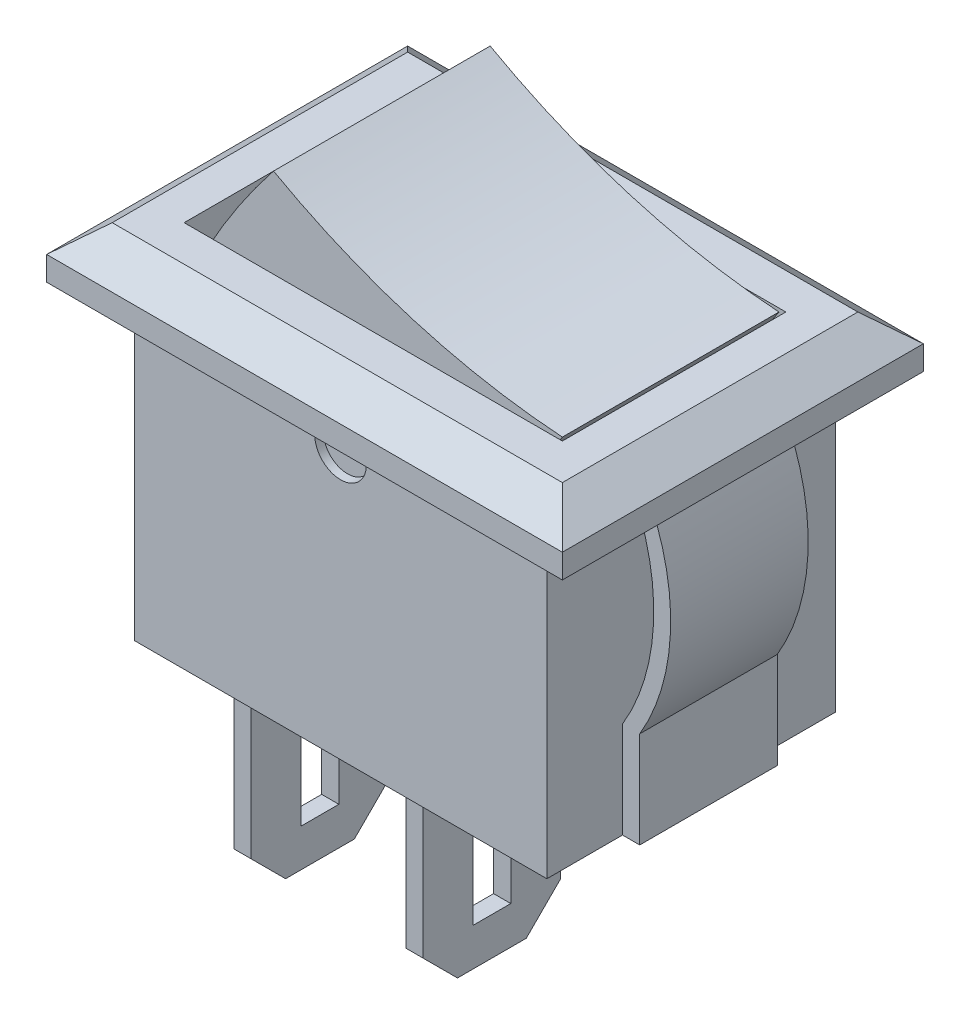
from build123d import *

# Parameters (mm, degrees)
CROQUIS1_W                 = 12
CROQUIS1_H                 = 8.4
SALIENTE_EXTRUIR1_DEPTH    = 8.8
CROQUIS2_W                 = 15
CROQUIS2_H                 = 10.5
SALIENTE_EXTRUIR2_DEPTH    = 0.7
CROQUIS3_W                 = 15
CROQUIS3_H                 = 10.5
SALIENTE_EXTRUIR3_DEPTH    = 0.8
SALIENTE_EXTRUIR3_TAPER    = 50
CROQUIS4_W                 = 11
CROQUIS4_H                 = 6.5
CORTAR_EXTRUIR1_DEPTH      = 9
CORTAR_EXTRUIR7_DEPTH      = 14.780511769
CORTAR_EXTRUIR7_DEPTH_BACK = 14.780511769
CROQUIS6_R                 = 0.75
SALIENTE_EXTRUIR4_DEPTH    = 3.15
CROQUIS7_R                 = 0.7
SALIENTE_EXTRUIR5_DEPTH    = 4
SALIENTE_EXTRUIR6_DEPTH    = 2
CROQUIS9_W                 = 0.5
CROQUIS9_H                 = 4
SALIENTE_EXTRUIR7_DEPTH    = 7
SALIENTE_EXTRUIR7_2_DEPTH  = 7
CORTAR_EXTRUIR8_DEPTH      = 19.84787796
CORTAR_EXTRUIR8_DEPTH_BACK = 19.84787796
CROQUIS10_W                = 1.1
CROQUIS10_H                = 2.6


with BuildPart() as part:
    # Croquis1 → Saliente-Extruir1 (new body)
    with BuildSketch(Plane(origin=(0, 0, 0), x_dir=(1, 0, 0), z_dir=(0, 1, 0))):
        Rectangle(CROQUIS1_W, CROQUIS1_H)
    extrude(amount=SALIENTE_EXTRUIR1_DEPTH)

    # Croquis2 → Saliente-Extruir2 (add)
    with BuildSketch(Plane(origin=(0, 8.8, 0), x_dir=(1, 0, 0), z_dir=(0, 1, 0))):
        Rectangle(CROQUIS2_W, CROQUIS2_H)
    extrude(amount=SALIENTE_EXTRUIR2_DEPTH)

    # Croquis3 → Saliente-Extruir3 (add)
    with BuildSketch(Plane(origin=(0, 9.5, 0), x_dir=(1, 0, 0), z_dir=(0, 1, 0))):
        Rectangle(CROQUIS3_W, CROQUIS3_H)
    extrude(amount=SALIENTE_EXTRUIR3_DEPTH, taper=SALIENTE_EXTRUIR3_TAPER)

    # Croquis4 → Cortar-Extruir1 (cut)
    with BuildSketch(Plane(origin=(0, 10.3, 0), x_dir=(1, 0, 0), z_dir=(0, 1, 0))):
        Rectangle(CROQUIS4_W, CROQUIS4_H)
    extrude(amount=-CORTAR_EXTRUIR1_DEPTH, mode=Mode.SUBTRACT)

    # Croquis6 → Cortar-Extruir7 (cut, two sides: drawn at the far end of the back side and taken through both)
    with BuildSketch(Plane.XY.offset(-CORTAR_EXTRUIR7_DEPTH_BACK)):
        with Locations((0, 7.8)):
            Circle(CROQUIS6_R)
    extrude(amount=CORTAR_EXTRUIR7_DEPTH + CORTAR_EXTRUIR7_DEPTH_BACK, mode=Mode.SUBTRACT)

    # Croquis8 → Saliente-Extruir6 (add, symmetric)
    with BuildSketch(Plane.XY):
        with BuildLine():
            Line((-6.5, 0), (-6.5, 2.8))
            ThreePointArc((-6.5, 2.8), (-7.391960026, 5.762901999), (-6.8, 8.8))
            Line((-6.8, 8.8), (-6.304155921, 8.8))
            ThreePointArc((-6.304155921, 8.8), (-6.9, 5.762085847), (-6, 2.8))
            Line((-6, 2.8), (-6, 0))
            Line((-6, 0), (-6.5, 0))
        make_face()
        with BuildLine():
            Line((6.5, 0), (6, 0))
            Line((6, 0), (6, 2.8))
            ThreePointArc((6, 2.8), (6.9, 5.762085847), (6.304155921, 8.8))
            Line((6.304155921, 8.8), (6.8, 8.8))
            ThreePointArc((6.8, 8.8), (7.391960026, 5.762901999), (6.5, 2.8))
            Line((6.5, 2.8), (6.5, 0))
        make_face()
    extrude(amount=SALIENTE_EXTRUIR6_DEPTH, both=True)


with BuildPart() as body_2:
    # Croquis5 → Saliente-Extruir4 (new, symmetric)
    with BuildSketch(Plane.XY):
        with BuildLine():
            ThreePointArc((-3, 12.8), (1.061376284, 11.084224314), (5.4, 10.3))
            ThreePointArc((5.4, 10.3), (0.330087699, 7.07524599), (-5.3, 9.174093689))
            ThreePointArc((-5.3, 9.174093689), (-4.24758894, 11.048949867), (-3, 12.8))
        make_face()
    extrude(amount=SALIENTE_EXTRUIR4_DEPTH, both=True)

    # Croquis7 → Saliente-Extruir5 (add, symmetric)
    with BuildSketch(Plane.XY):
        with Locations((0, 7.8)):
            Circle(CROQUIS7_R)
    extrude(amount=SALIENTE_EXTRUIR5_DEPTH, both=True)


with BuildPart() as body_3:
    # Croquis9 → Saliente-Extruir7 (new body)
    with BuildSketch(Plane.XZ):
        with Locations((-5.05, 0)):
            Rectangle(CROQUIS9_W, CROQUIS9_H)
    extrude(amount=SALIENTE_EXTRUIR7_DEPTH)


with BuildPart() as body_4:
    # Croquis9 → Saliente-Extruir7 2 (new body)
    with BuildSketch(Plane.XZ):
        with Locations((-0.05, 0)):
            Rectangle(CROQUIS9_W, CROQUIS9_H)
    extrude(amount=SALIENTE_EXTRUIR7_2_DEPTH)


with BuildPart() as cortar_extruir8_tool:
    # Croquis10 → Cortar-Extruir8 (new, two sides: drawn at the far end of the back side and taken through both)
    with BuildSketch(Plane.ZY.offset(5.3).offset(-CORTAR_EXTRUIR8_DEPTH_BACK)):
        with Locations((0, -4.6)):
            Rectangle(CROQUIS10_W, CROQUIS10_H)
        Polygon((-2, -6), (-1, -7), (-2, -7), align=None)
        Polygon((2, -6), (1, -7), (2, -7), align=None)
    extrude(amount=CORTAR_EXTRUIR8_DEPTH + CORTAR_EXTRUIR8_DEPTH_BACK)


with BuildPart() as body_3_1:
    add(body_3.part)

    # Cortar-Extruir8: cut by cortar_extruir8_tool
    add(cortar_extruir8_tool.part, mode=Mode.SUBTRACT)


with BuildPart() as body_4_1:
    add(body_4.part)

    # Cortar-Extruir8: cut by cortar_extruir8_tool
    add(cortar_extruir8_tool.part, mode=Mode.SUBTRACT)


solid = Compound([part.part, body_2.part, body_3_1.part, body_4_1.part])
